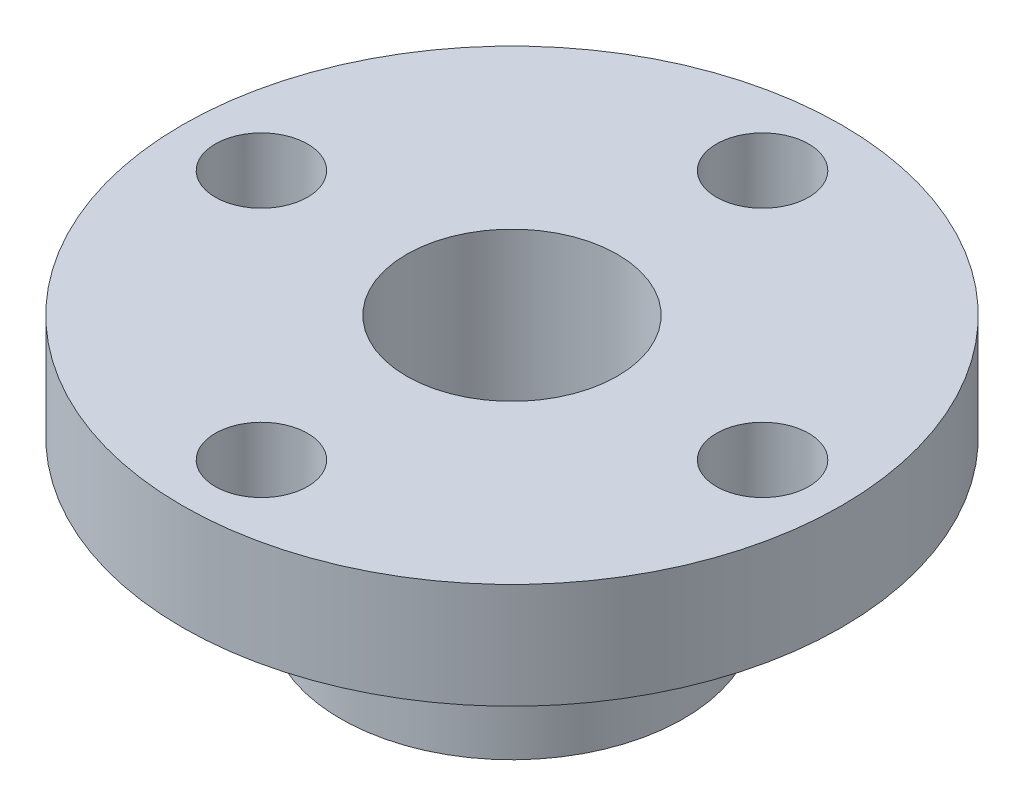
ISO-10303-21;
HEADER;
FILE_DESCRIPTION(('STEP AP214'),'2;1');
FILE_NAME('part.step','',(''),(''),'','','');
FILE_SCHEMA(('AUTOMOTIVE_DESIGN { 1 0 10303 214 1 1 1 1 }'));
ENDSEC;
DATA;
#1=APPLICATION_CONTEXT('core data for automotive mechanical design processes');
#2=APPLICATION_PROTOCOL_DEFINITION('international standard','automotive_design',2000,#1);
#3=PRODUCT_CONTEXT('',#1,'mechanical');
#4=PRODUCT('Part','Part','',(#3));
#5=PRODUCT_RELATED_PRODUCT_CATEGORY('part','',(#4));
#6=PRODUCT_DEFINITION_FORMATION('','',#4);
#7=PRODUCT_DEFINITION_CONTEXT('part definition',#1,'design');
#8=PRODUCT_DEFINITION('design','',#6,#7);
#9=PRODUCT_DEFINITION_SHAPE('','',#8);
#10=(LENGTH_UNIT() NAMED_UNIT(*) SI_UNIT(.MILLI.,.METRE.));
#11=(NAMED_UNIT(*) PLANE_ANGLE_UNIT() SI_UNIT($,.RADIAN.));
#12=(NAMED_UNIT(*) SI_UNIT($,.STERADIAN.) SOLID_ANGLE_UNIT());
#13=UNCERTAINTY_MEASURE_WITH_UNIT(LENGTH_MEASURE(1.E-05),#10,'distance_accuracy_value','');
#14=(GEOMETRIC_REPRESENTATION_CONTEXT(3) GLOBAL_UNCERTAINTY_ASSIGNED_CONTEXT((#13)) GLOBAL_UNIT_ASSIGNED_CONTEXT((#10,
#11,#12)) REPRESENTATION_CONTEXT('',''));
#15=CARTESIAN_POINT('',(0.,0.,0.));
#16=DIRECTION('',(0.,0.,1.));
#17=DIRECTION('',(1.,0.,0.));
#18=AXIS2_PLACEMENT_3D('',#15,#16,#17);
#19=CARTESIAN_POINT('',(0.,0.,0.));
#20=DIRECTION('',(0.,1.,0.));
#21=DIRECTION('',(0.,0.,1.));
#22=AXIS2_PLACEMENT_3D('',#19,#20,#21);
#23=PLANE('',#22);
#24=CARTESIAN_POINT('',(0.,0.,-9.5));
#25=DIRECTION('',(0.,1.,0.));
#26=DIRECTION('',(0.,0.,1.));
#27=AXIS2_PLACEMENT_3D('',#24,#25,#26);
#28=CIRCLE('',#27,1.75);
#29=CARTESIAN_POINT('',(0.,0.,-7.75));
#30=VERTEX_POINT('',#29);
#31=EDGE_CURVE('E70',#30,#30,#28,.T.);
#32=ORIENTED_EDGE('',*,*,#31,.F.);
#33=EDGE_LOOP('',(#32));
#34=FACE_BOUND('',#33,.T.);
#35=CARTESIAN_POINT('',(9.5,0.,0.));
#36=DIRECTION('',(0.,1.,0.));
#37=DIRECTION('',(0.,0.,1.));
#38=AXIS2_PLACEMENT_3D('',#35,#36,#37);
#39=CIRCLE('',#38,1.75);
#40=CARTESIAN_POINT('',(9.5,0.,1.75));
#41=VERTEX_POINT('',#40);
#42=EDGE_CURVE('E73',#41,#41,#39,.T.);
#43=ORIENTED_EDGE('',*,*,#42,.F.);
#44=EDGE_LOOP('',(#43));
#45=FACE_BOUND('',#44,.T.);
#46=CARTESIAN_POINT('',(0.,0.,9.5));
#47=DIRECTION('',(0.,1.,0.));
#48=DIRECTION('',(0.,0.,1.));
#49=AXIS2_PLACEMENT_3D('',#46,#47,#48);
#50=CIRCLE('',#49,1.75);
#51=CARTESIAN_POINT('',(0.,0.,11.25));
#52=VERTEX_POINT('',#51);
#53=EDGE_CURVE('E76',#52,#52,#50,.T.);
#54=ORIENTED_EDGE('',*,*,#53,.F.);
#55=EDGE_LOOP('',(#54));
#56=FACE_BOUND('',#55,.T.);
#57=CARTESIAN_POINT('',(-9.5,0.,0.));
#58=DIRECTION('',(0.,1.,0.));
#59=DIRECTION('',(0.,0.,1.));
#60=AXIS2_PLACEMENT_3D('',#57,#58,#59);
#61=CIRCLE('',#60,1.75);
#62=CARTESIAN_POINT('',(-9.5,0.,1.75));
#63=VERTEX_POINT('',#62);
#64=EDGE_CURVE('E79',#63,#63,#61,.T.);
#65=ORIENTED_EDGE('',*,*,#64,.F.);
#66=EDGE_LOOP('',(#65));
#67=FACE_BOUND('',#66,.T.);
#68=CARTESIAN_POINT('',(0.,0.,0.));
#69=DIRECTION('',(0.,1.,0.));
#70=DIRECTION('',(0.,0.,1.));
#71=AXIS2_PLACEMENT_3D('',#68,#69,#70);
#72=CIRCLE('',#71,4.);
#73=CARTESIAN_POINT('',(0.,0.,4.));
#74=VERTEX_POINT('',#73);
#75=EDGE_CURVE('E67',#74,#74,#72,.T.);
#76=ORIENTED_EDGE('',*,*,#75,.F.);
#77=EDGE_LOOP('',(#76));
#78=FACE_BOUND('',#77,.T.);
#79=CARTESIAN_POINT('',(0.,0.,0.));
#80=DIRECTION('',(0.,-1.,0.));
#81=DIRECTION('',(0.,0.,-1.));
#82=AXIS2_PLACEMENT_3D('',#79,#80,#81);
#83=CIRCLE('',#82,12.5);
#84=CARTESIAN_POINT('',(0.,0.,-12.5));
#85=VERTEX_POINT('',#84);
#86=EDGE_CURVE('E10',#85,#85,#83,.T.);
#87=ORIENTED_EDGE('',*,*,#86,.F.);
#88=EDGE_LOOP('',(#87));
#89=FACE_BOUND('',#88,.T.);
#90=ADVANCED_FACE('F31',(#34,#45,#56,#67,#78,#89),#23,.T.);
#91=CARTESIAN_POINT('',(0.,-10.,0.));
#92=DIRECTION('',(0.,-1.,0.));
#93=DIRECTION('',(0.,0.,-1.));
#94=AXIS2_PLACEMENT_3D('',#91,#92,#93);
#95=CYLINDRICAL_SURFACE('',#94,12.5);
#96=ORIENTED_EDGE('',*,*,#86,.T.);
#97=EDGE_LOOP('',(#96));
#98=FACE_BOUND('',#97,.T.);
#99=CARTESIAN_POINT('',(0.,-4.,0.));
#100=DIRECTION('',(0.,-1.,0.));
#101=DIRECTION('',(0.,0.,-1.));
#102=AXIS2_PLACEMENT_3D('',#99,#100,#101);
#103=CIRCLE('',#102,12.5);
#104=CARTESIAN_POINT('',(0.,-4.,-12.5));
#105=VERTEX_POINT('',#104);
#106=EDGE_CURVE('E38',#105,#105,#103,.T.);
#107=ORIENTED_EDGE('',*,*,#106,.F.);
#108=EDGE_LOOP('',(#107));
#109=FACE_BOUND('',#108,.T.);
#110=ADVANCED_FACE('F89',(#98,#109),#95,.T.);
#111=CARTESIAN_POINT('',(12.5,-4.,0.));
#112=DIRECTION('',(0.,-1.,0.));
#113=DIRECTION('',(0.,0.,-1.));
#114=AXIS2_PLACEMENT_3D('',#111,#112,#113);
#115=PLANE('',#114);
#116=CARTESIAN_POINT('',(0.,-4.,-9.5));
#117=DIRECTION('',(0.,-1.,0.));
#118=DIRECTION('',(0.,0.,-1.));
#119=AXIS2_PLACEMENT_3D('',#116,#117,#118);
#120=CIRCLE('',#119,1.75);
#121=CARTESIAN_POINT('',(0.,-4.,-11.25));
#122=VERTEX_POINT('',#121);
#123=EDGE_CURVE('E34',#122,#122,#120,.T.);
#124=ORIENTED_EDGE('',*,*,#123,.F.);
#125=EDGE_LOOP('',(#124));
#126=FACE_BOUND('',#125,.T.);
#127=CARTESIAN_POINT('',(9.5,-4.,0.));
#128=DIRECTION('',(0.,-1.,0.));
#129=DIRECTION('',(0.,0.,-1.));
#130=AXIS2_PLACEMENT_3D('',#127,#128,#129);
#131=CIRCLE('',#130,1.75);
#132=CARTESIAN_POINT('',(9.5,-4.,-1.75));
#133=VERTEX_POINT('',#132);
#134=EDGE_CURVE('E53',#133,#133,#131,.T.);
#135=ORIENTED_EDGE('',*,*,#134,.F.);
#136=EDGE_LOOP('',(#135));
#137=FACE_BOUND('',#136,.T.);
#138=CARTESIAN_POINT('',(0.,-4.,9.5));
#139=DIRECTION('',(0.,-1.,0.));
#140=DIRECTION('',(0.,0.,-1.));
#141=AXIS2_PLACEMENT_3D('',#138,#139,#140);
#142=CIRCLE('',#141,1.75);
#143=CARTESIAN_POINT('',(0.,-4.,7.75));
#144=VERTEX_POINT('',#143);
#145=EDGE_CURVE('E50',#144,#144,#142,.T.);
#146=ORIENTED_EDGE('',*,*,#145,.F.);
#147=EDGE_LOOP('',(#146));
#148=FACE_BOUND('',#147,.T.);
#149=CARTESIAN_POINT('',(-9.5,-4.,0.));
#150=DIRECTION('',(0.,-1.,0.));
#151=DIRECTION('',(0.,0.,-1.));
#152=AXIS2_PLACEMENT_3D('',#149,#150,#151);
#153=CIRCLE('',#152,1.75);
#154=CARTESIAN_POINT('',(-9.5,-4.,-1.75));
#155=VERTEX_POINT('',#154);
#156=EDGE_CURVE('E47',#155,#155,#153,.T.);
#157=ORIENTED_EDGE('',*,*,#156,.F.);
#158=EDGE_LOOP('',(#157));
#159=FACE_BOUND('',#158,.T.);
#160=ORIENTED_EDGE('',*,*,#106,.T.);
#161=EDGE_LOOP('',(#160));
#162=FACE_BOUND('',#161,.T.);
#163=CARTESIAN_POINT('',(0.,-4.,0.));
#164=DIRECTION('',(0.,-1.,0.));
#165=DIRECTION('',(0.,0.,-1.));
#166=AXIS2_PLACEMENT_3D('',#163,#164,#165);
#167=CIRCLE('',#166,6.5);
#168=CARTESIAN_POINT('',(0.,-4.,-6.5));
#169=VERTEX_POINT('',#168);
#170=EDGE_CURVE('E43',#169,#169,#167,.T.);
#171=ORIENTED_EDGE('',*,*,#170,.F.);
#172=EDGE_LOOP('',(#171));
#173=FACE_BOUND('',#172,.T.);
#174=ADVANCED_FACE('F118',(#126,#137,#148,#159,#162,#173),#115,.T.);
#175=CARTESIAN_POINT('',(0.,-10.,0.));
#176=DIRECTION('',(0.,-1.,0.));
#177=DIRECTION('',(0.,0.,-1.));
#178=AXIS2_PLACEMENT_3D('',#175,#176,#177);
#179=CYLINDRICAL_SURFACE('',#178,6.5);
#180=ORIENTED_EDGE('',*,*,#170,.T.);
#181=EDGE_LOOP('',(#180));
#182=FACE_BOUND('',#181,.T.);
#183=CARTESIAN_POINT('',(0.,-10.,0.));
#184=DIRECTION('',(0.,-1.,0.));
#185=DIRECTION('',(0.,0.,-1.));
#186=AXIS2_PLACEMENT_3D('',#183,#184,#185);
#187=CIRCLE('',#186,6.5);
#188=CARTESIAN_POINT('',(0.,-10.,-6.5));
#189=VERTEX_POINT('',#188);
#190=EDGE_CURVE('E58',#189,#189,#187,.T.);
#191=ORIENTED_EDGE('',*,*,#190,.F.);
#192=EDGE_LOOP('',(#191));
#193=FACE_BOUND('',#192,.T.);
#194=ADVANCED_FACE('F108',(#182,#193),#179,.T.);
#195=CARTESIAN_POINT('',(6.5,-10.,0.));
#196=DIRECTION('',(0.,-1.,0.));
#197=DIRECTION('',(0.,0.,-1.));
#198=AXIS2_PLACEMENT_3D('',#195,#196,#197);
#199=PLANE('',#198);
#200=CARTESIAN_POINT('',(0.,-10.,0.));
#201=DIRECTION('',(0.,1.,0.));
#202=DIRECTION('',(0.,0.,1.));
#203=AXIS2_PLACEMENT_3D('',#200,#201,#202);
#204=CIRCLE('',#203,4.);
#205=CARTESIAN_POINT('',(0.,-10.,4.));
#206=VERTEX_POINT('',#205);
#207=EDGE_CURVE('E51',#206,#206,#204,.T.);
#208=ORIENTED_EDGE('',*,*,#207,.T.);
#209=EDGE_LOOP('',(#208));
#210=FACE_BOUND('',#209,.T.);
#211=ORIENTED_EDGE('',*,*,#190,.T.);
#212=EDGE_LOOP('',(#211));
#213=FACE_BOUND('',#212,.T.);
#214=ADVANCED_FACE('F99',(#210,#213),#199,.T.);
#215=CARTESIAN_POINT('',(0.,-10.,0.));
#216=DIRECTION('',(0.,1.,0.));
#217=DIRECTION('',(0.,0.,1.));
#218=AXIS2_PLACEMENT_3D('',#215,#216,#217);
#219=CYLINDRICAL_SURFACE('',#218,4.);
#220=ORIENTED_EDGE('',*,*,#207,.F.);
#221=EDGE_LOOP('',(#220));
#222=FACE_BOUND('',#221,.T.);
#223=ORIENTED_EDGE('',*,*,#75,.T.);
#224=EDGE_LOOP('',(#223));
#225=FACE_BOUND('',#224,.T.);
#226=ADVANCED_FACE('F96',(#222,#225),#219,.F.);
#227=CARTESIAN_POINT('',(-9.5,-10.,0.));
#228=DIRECTION('',(0.,1.,0.));
#229=DIRECTION('',(0.,0.,1.));
#230=AXIS2_PLACEMENT_3D('',#227,#228,#229);
#231=CYLINDRICAL_SURFACE('',#230,1.75);
#232=ORIENTED_EDGE('',*,*,#156,.T.);
#233=EDGE_LOOP('',(#232));
#234=FACE_BOUND('',#233,.T.);
#235=ORIENTED_EDGE('',*,*,#64,.T.);
#236=EDGE_LOOP('',(#235));
#237=FACE_BOUND('',#236,.T.);
#238=ADVANCED_FACE('F98',(#234,#237),#231,.F.);
#239=CARTESIAN_POINT('',(0.,-10.,9.5));
#240=DIRECTION('',(0.,1.,0.));
#241=DIRECTION('',(0.,0.,1.));
#242=AXIS2_PLACEMENT_3D('',#239,#240,#241);
#243=CYLINDRICAL_SURFACE('',#242,1.75);
#244=ORIENTED_EDGE('',*,*,#145,.T.);
#245=EDGE_LOOP('',(#244));
#246=FACE_BOUND('',#245,.T.);
#247=ORIENTED_EDGE('',*,*,#53,.T.);
#248=EDGE_LOOP('',(#247));
#249=FACE_BOUND('',#248,.T.);
#250=ADVANCED_FACE('F85',(#246,#249),#243,.F.);
#251=CARTESIAN_POINT('',(9.5,-10.,0.));
#252=DIRECTION('',(0.,1.,0.));
#253=DIRECTION('',(0.,0.,1.));
#254=AXIS2_PLACEMENT_3D('',#251,#252,#253);
#255=CYLINDRICAL_SURFACE('',#254,1.75);
#256=ORIENTED_EDGE('',*,*,#134,.T.);
#257=EDGE_LOOP('',(#256));
#258=FACE_BOUND('',#257,.T.);
#259=ORIENTED_EDGE('',*,*,#42,.T.);
#260=EDGE_LOOP('',(#259));
#261=FACE_BOUND('',#260,.T.);
#262=ADVANCED_FACE('F113',(#258,#261),#255,.F.);
#263=CARTESIAN_POINT('',(0.,-10.,-9.5));
#264=DIRECTION('',(0.,1.,0.));
#265=DIRECTION('',(0.,0.,1.));
#266=AXIS2_PLACEMENT_3D('',#263,#264,#265);
#267=CYLINDRICAL_SURFACE('',#266,1.75);
#268=ORIENTED_EDGE('',*,*,#123,.T.);
#269=EDGE_LOOP('',(#268));
#270=FACE_BOUND('',#269,.T.);
#271=ORIENTED_EDGE('',*,*,#31,.T.);
#272=EDGE_LOOP('',(#271));
#273=FACE_BOUND('',#272,.T.);
#274=ADVANCED_FACE('F173',(#270,#273),#267,.F.);
#275=CLOSED_SHELL('',(#90,#110,#174,#194,#214,#226,#238,#250,#262,#274));
#276=MANIFOLD_SOLID_BREP('B2',#275);
#277=ADVANCED_BREP_SHAPE_REPRESENTATION('',(#18,#276),#14);
#278=SHAPE_DEFINITION_REPRESENTATION(#9,#277);
ENDSEC;
END-ISO-10303-21;
